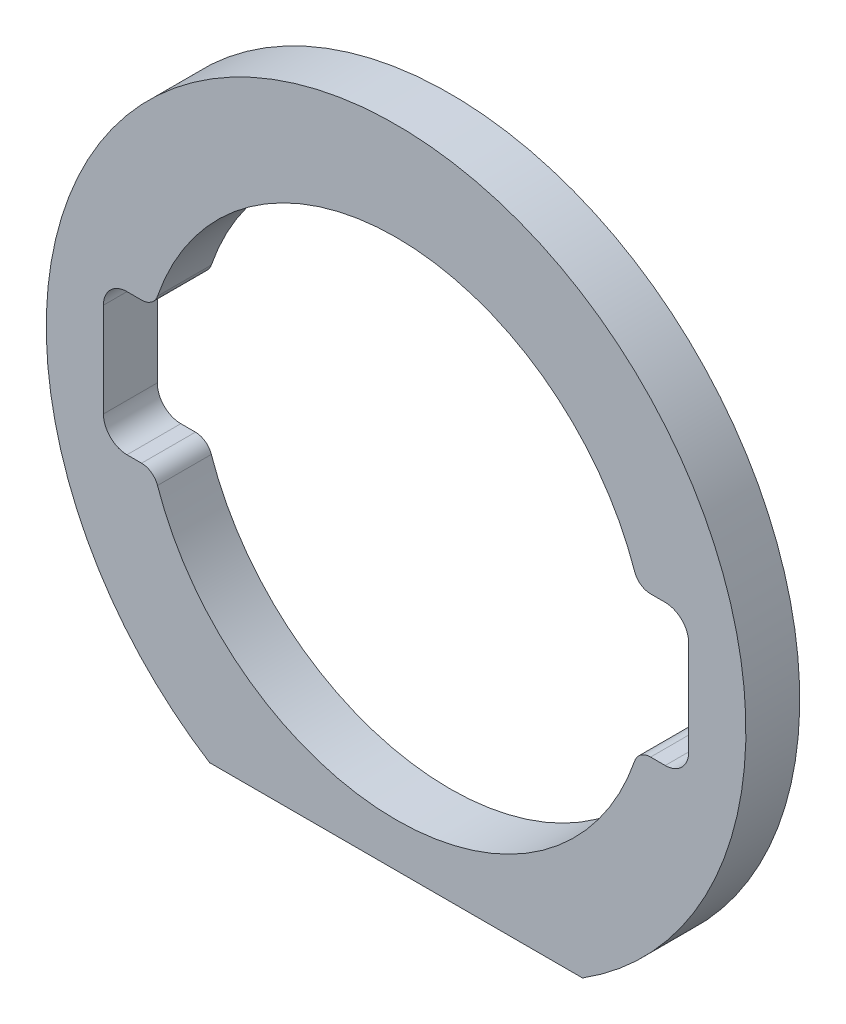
ISO-10303-21;
HEADER;
FILE_DESCRIPTION(('STEP AP214'),'2;1');
FILE_NAME('part.step','',(''),(''),'','','');
FILE_SCHEMA(('AUTOMOTIVE_DESIGN { 1 0 10303 214 1 1 1 1 }'));
ENDSEC;
DATA;
#1=APPLICATION_CONTEXT('core data for automotive mechanical design processes');
#2=APPLICATION_PROTOCOL_DEFINITION('international standard','automotive_design',2000,#1);
#3=PRODUCT_CONTEXT('',#1,'mechanical');
#4=PRODUCT('Part','Part','',(#3));
#5=PRODUCT_RELATED_PRODUCT_CATEGORY('part','',(#4));
#6=PRODUCT_DEFINITION_FORMATION('','',#4);
#7=PRODUCT_DEFINITION_CONTEXT('part definition',#1,'design');
#8=PRODUCT_DEFINITION('design','',#6,#7);
#9=PRODUCT_DEFINITION_SHAPE('','',#8);
#10=(LENGTH_UNIT() NAMED_UNIT(*) SI_UNIT(.MILLI.,.METRE.));
#11=(NAMED_UNIT(*) PLANE_ANGLE_UNIT() SI_UNIT($,.RADIAN.));
#12=(NAMED_UNIT(*) SI_UNIT($,.STERADIAN.) SOLID_ANGLE_UNIT());
#13=UNCERTAINTY_MEASURE_WITH_UNIT(LENGTH_MEASURE(1.E-05),#10,'distance_accuracy_value','');
#14=(GEOMETRIC_REPRESENTATION_CONTEXT(3) GLOBAL_UNCERTAINTY_ASSIGNED_CONTEXT((#13)) GLOBAL_UNIT_ASSIGNED_CONTEXT((#10,
#11,#12)) REPRESENTATION_CONTEXT('',''));
#15=CARTESIAN_POINT('',(0.,0.,0.));
#16=DIRECTION('',(0.,0.,1.));
#17=DIRECTION('',(1.,0.,0.));
#18=AXIS2_PLACEMENT_3D('',#15,#16,#17);
#19=CARTESIAN_POINT('',(0.,0.,8.));
#20=DIRECTION('',(0.,0.,-1.));
#21=DIRECTION('',(-1.,0.,0.));
#22=AXIS2_PLACEMENT_3D('',#19,#20,#21);
#23=CYLINDRICAL_SURFACE('',#22,52.);
#24=CARTESIAN_POINT('',(0.,0.,0.));
#25=DIRECTION('',(0.,0.,1.));
#26=DIRECTION('',(1.,0.,0.));
#27=AXIS2_PLACEMENT_3D('',#24,#25,#26);
#28=CIRCLE('',#27,52.);
#29=CARTESIAN_POINT('',(27.7128129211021,-44.,0.));
#30=VERTEX_POINT('',#29);
#31=CARTESIAN_POINT('',(-27.7128129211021,-44.,0.));
#32=VERTEX_POINT('',#31);
#33=EDGE_CURVE('E218',#30,#32,#28,.T.);
#34=ORIENTED_EDGE('',*,*,#33,.T.);
#35=DIRECTION('',(0.,0.,-1.));
#36=VECTOR('',#35,1.);
#37=CARTESIAN_POINT('',(-27.7128129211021,-44.,8.));
#38=LINE('',#37,#36);
#39=CARTESIAN_POINT('',(-27.7128129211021,-44.,8.));
#40=VERTEX_POINT('',#39);
#41=EDGE_CURVE('E257',#40,#32,#38,.T.);
#42=ORIENTED_EDGE('',*,*,#41,.F.);
#43=CARTESIAN_POINT('',(0.,0.,8.));
#44=DIRECTION('',(0.,0.,1.));
#45=DIRECTION('',(1.,0.,0.));
#46=AXIS2_PLACEMENT_3D('',#43,#44,#45);
#47=CIRCLE('',#46,52.);
#48=CARTESIAN_POINT('',(27.7128129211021,-44.,8.));
#49=VERTEX_POINT('',#48);
#50=EDGE_CURVE('E245',#49,#40,#47,.T.);
#51=ORIENTED_EDGE('',*,*,#50,.F.);
#52=DIRECTION('',(0.,0.,-1.));
#53=VECTOR('',#52,1.);
#54=CARTESIAN_POINT('',(27.7128129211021,-44.,8.));
#55=LINE('',#54,#53);
#56=EDGE_CURVE('E251',#49,#30,#55,.T.);
#57=ORIENTED_EDGE('',*,*,#56,.T.);
#58=EDGE_LOOP('',(#34,#42,#51,#57));
#59=FACE_BOUND('',#58,.T.);
#60=ADVANCED_FACE('F31',(#59),#23,.T.);
#61=CARTESIAN_POINT('',(-27.7128129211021,-44.,8.));
#62=DIRECTION('',(0.,1.,0.));
#63=DIRECTION('',(0.,0.,1.));
#64=AXIS2_PLACEMENT_3D('',#61,#62,#63);
#65=PLANE('',#64);
#66=DIRECTION('',(1.,0.,0.));
#67=VECTOR('',#66,1.);
#68=CARTESIAN_POINT('',(-27.7128129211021,-44.,0.));
#69=LINE('',#68,#67);
#70=EDGE_CURVE('E249',#32,#30,#69,.T.);
#71=ORIENTED_EDGE('',*,*,#70,.T.);
#72=ORIENTED_EDGE('',*,*,#56,.F.);
#73=DIRECTION('',(1.,0.,0.));
#74=VECTOR('',#73,1.);
#75=CARTESIAN_POINT('',(-27.7128129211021,-44.,8.));
#76=LINE('',#75,#74);
#77=EDGE_CURVE('E248',#40,#49,#76,.T.);
#78=ORIENTED_EDGE('',*,*,#77,.F.);
#79=ORIENTED_EDGE('',*,*,#41,.T.);
#80=EDGE_LOOP('',(#71,#72,#78,#79));
#81=FACE_BOUND('',#80,.T.);
#82=ADVANCED_FACE('F364',(#81),#65,.F.);
#83=CARTESIAN_POINT('',(0.,0.,8.));
#84=DIRECTION('',(0.,0.,1.));
#85=DIRECTION('',(1.,0.,0.));
#86=AXIS2_PLACEMENT_3D('',#83,#84,#85);
#87=PLANE('',#86);
#88=CARTESIAN_POINT('',(37.8285606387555,13.,8.));
#89=DIRECTION('',(0.,0.,-1.));
#90=DIRECTION('',(1.,0.,0.));
#91=AXIS2_PLACEMENT_3D('',#88,#89,#90);
#92=CIRCLE('',#91,2.5);
#93=CARTESIAN_POINT('',(37.8285606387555,10.5,8.));
#94=VERTEX_POINT('',#93);
#95=CARTESIAN_POINT('',(35.4642755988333,12.1875,8.));
#96=VERTEX_POINT('',#95);
#97=EDGE_CURVE('E45',#94,#96,#92,.T.);
#98=ORIENTED_EDGE('',*,*,#97,.F.);
#99=DIRECTION('',(-1.,0.,0.));
#100=VECTOR('',#99,1.);
#101=CARTESIAN_POINT('',(37.8285606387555,10.5,8.));
#102=LINE('',#101,#100);
#103=CARTESIAN_POINT('',(40.,10.5,8.));
#104=VERTEX_POINT('',#103);
#105=EDGE_CURVE('E213',#104,#94,#102,.T.);
#106=ORIENTED_EDGE('',*,*,#105,.F.);
#107=CARTESIAN_POINT('',(40.,7.,8.));
#108=DIRECTION('',(0.,0.,1.));
#109=DIRECTION('',(-1.,0.,0.));
#110=AXIS2_PLACEMENT_3D('',#107,#108,#109);
#111=CIRCLE('',#110,3.5);
#112=CARTESIAN_POINT('',(43.5,6.99999999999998,8.));
#113=VERTEX_POINT('',#112);
#114=EDGE_CURVE('E210',#113,#104,#111,.T.);
#115=ORIENTED_EDGE('',*,*,#114,.F.);
#116=DIRECTION('',(0.,1.,0.));
#117=VECTOR('',#116,1.);
#118=CARTESIAN_POINT('',(43.5,6.99999999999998,8.));
#119=LINE('',#118,#117);
#120=CARTESIAN_POINT('',(43.5,-6.99999999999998,8.));
#121=VERTEX_POINT('',#120);
#122=EDGE_CURVE('E207',#121,#113,#119,.T.);
#123=ORIENTED_EDGE('',*,*,#122,.F.);
#124=CARTESIAN_POINT('',(40.,-7.,8.));
#125=DIRECTION('',(0.,0.,1.));
#126=DIRECTION('',(1.,0.,0.));
#127=AXIS2_PLACEMENT_3D('',#124,#125,#126);
#128=CIRCLE('',#127,3.5);
#129=CARTESIAN_POINT('',(40.,-10.5,8.));
#130=VERTEX_POINT('',#129);
#131=EDGE_CURVE('E204',#130,#121,#128,.T.);
#132=ORIENTED_EDGE('',*,*,#131,.F.);
#133=DIRECTION('',(1.,0.,0.));
#134=VECTOR('',#133,1.);
#135=CARTESIAN_POINT('',(37.8285606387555,-10.5,8.));
#136=LINE('',#135,#134);
#137=CARTESIAN_POINT('',(37.8285606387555,-10.5,8.));
#138=VERTEX_POINT('',#137);
#139=EDGE_CURVE('E201',#138,#130,#136,.T.);
#140=ORIENTED_EDGE('',*,*,#139,.F.);
#141=CARTESIAN_POINT('',(37.8285606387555,-13.,8.));
#142=DIRECTION('',(0.,0.,-1.));
#143=DIRECTION('',(-1.,0.,0.));
#144=AXIS2_PLACEMENT_3D('',#141,#142,#143);
#145=CIRCLE('',#144,2.5);
#146=CARTESIAN_POINT('',(35.4642755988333,-12.1875,8.));
#147=VERTEX_POINT('',#146);
#148=EDGE_CURVE('E198',#147,#138,#145,.T.);
#149=ORIENTED_EDGE('',*,*,#148,.F.);
#150=CARTESIAN_POINT('',(0.,0.,8.));
#151=DIRECTION('',(0.,0.,1.));
#152=DIRECTION('',(1.,0.,0.));
#153=AXIS2_PLACEMENT_3D('',#150,#151,#152);
#154=CIRCLE('',#153,37.5);
#155=CARTESIAN_POINT('',(-35.4642755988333,-12.1875,8.));
#156=VERTEX_POINT('',#155);
#157=EDGE_CURVE('E195',#156,#147,#154,.T.);
#158=ORIENTED_EDGE('',*,*,#157,.F.);
#159=CARTESIAN_POINT('',(-37.8285606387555,-13.,8.));
#160=DIRECTION('',(0.,0.,-1.));
#161=DIRECTION('',(1.,0.,0.));
#162=AXIS2_PLACEMENT_3D('',#159,#160,#161);
#163=CIRCLE('',#162,2.5);
#164=CARTESIAN_POINT('',(-37.8285606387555,-10.5,8.));
#165=VERTEX_POINT('',#164);
#166=EDGE_CURVE('E192',#165,#156,#163,.T.);
#167=ORIENTED_EDGE('',*,*,#166,.F.);
#168=DIRECTION('',(1.,0.,0.));
#169=VECTOR('',#168,1.);
#170=CARTESIAN_POINT('',(-40.,-10.5,8.));
#171=LINE('',#170,#169);
#172=CARTESIAN_POINT('',(-40.,-10.5,8.));
#173=VERTEX_POINT('',#172);
#174=EDGE_CURVE('E189',#173,#165,#171,.T.);
#175=ORIENTED_EDGE('',*,*,#174,.F.);
#176=CARTESIAN_POINT('',(-40.,-7.,8.));
#177=DIRECTION('',(0.,0.,1.));
#178=DIRECTION('',(-1.,0.,0.));
#179=AXIS2_PLACEMENT_3D('',#176,#177,#178);
#180=CIRCLE('',#179,3.5);
#181=CARTESIAN_POINT('',(-43.5,-6.99999999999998,8.));
#182=VERTEX_POINT('',#181);
#183=EDGE_CURVE('E186',#182,#173,#180,.T.);
#184=ORIENTED_EDGE('',*,*,#183,.F.);
#185=DIRECTION('',(0.,-1.,0.));
#186=VECTOR('',#185,1.);
#187=CARTESIAN_POINT('',(-43.5,6.99999999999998,8.));
#188=LINE('',#187,#186);
#189=CARTESIAN_POINT('',(-43.5,6.99999999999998,8.));
#190=VERTEX_POINT('',#189);
#191=EDGE_CURVE('E183',#190,#182,#188,.T.);
#192=ORIENTED_EDGE('',*,*,#191,.F.);
#193=CARTESIAN_POINT('',(-40.,7.,8.));
#194=DIRECTION('',(0.,0.,1.));
#195=DIRECTION('',(1.,0.,0.));
#196=AXIS2_PLACEMENT_3D('',#193,#194,#195);
#197=CIRCLE('',#196,3.5);
#198=CARTESIAN_POINT('',(-40.,10.5,8.));
#199=VERTEX_POINT('',#198);
#200=EDGE_CURVE('E177',#199,#190,#197,.T.);
#201=ORIENTED_EDGE('',*,*,#200,.F.);
#202=DIRECTION('',(-1.,0.,0.));
#203=VECTOR('',#202,1.);
#204=CARTESIAN_POINT('',(-40.,10.5,8.));
#205=LINE('',#204,#203);
#206=CARTESIAN_POINT('',(-37.8285606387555,10.5,8.));
#207=VERTEX_POINT('',#206);
#208=EDGE_CURVE('E175',#207,#199,#205,.T.);
#209=ORIENTED_EDGE('',*,*,#208,.F.);
#210=CARTESIAN_POINT('',(-37.8285606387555,13.,8.));
#211=DIRECTION('',(0.,0.,-1.));
#212=DIRECTION('',(1.,0.,0.));
#213=AXIS2_PLACEMENT_3D('',#210,#211,#212);
#214=CIRCLE('',#213,2.5);
#215=CARTESIAN_POINT('',(-35.4642755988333,12.1875,8.));
#216=VERTEX_POINT('',#215);
#217=EDGE_CURVE('E158',#216,#207,#214,.T.);
#218=ORIENTED_EDGE('',*,*,#217,.F.);
#219=CARTESIAN_POINT('',(0.,0.,8.));
#220=DIRECTION('',(0.,0.,1.));
#221=DIRECTION('',(1.,0.,0.));
#222=AXIS2_PLACEMENT_3D('',#219,#220,#221);
#223=CIRCLE('',#222,37.5);
#224=EDGE_CURVE('E167',#96,#216,#223,.T.);
#225=ORIENTED_EDGE('',*,*,#224,.F.);
#226=EDGE_LOOP('',(#98,#106,#115,#123,#132,#140,#149,#158,#167,#175,#184,#192,#201,#209,#218,#225));
#227=FACE_BOUND('',#226,.T.);
#228=ORIENTED_EDGE('',*,*,#50,.T.);
#229=ORIENTED_EDGE('',*,*,#77,.T.);
#230=EDGE_LOOP('',(#228,#229));
#231=FACE_BOUND('',#230,.T.);
#232=ADVANCED_FACE('F171',(#227,#231),#87,.T.);
#233=CARTESIAN_POINT('',(0.,0.,0.));
#234=DIRECTION('',(0.,0.,1.));
#235=DIRECTION('',(1.,0.,0.));
#236=AXIS2_PLACEMENT_3D('',#233,#234,#235);
#237=PLANE('',#236);
#238=DIRECTION('',(-1.,0.,0.));
#239=VECTOR('',#238,1.);
#240=CARTESIAN_POINT('',(0.,10.5,0.));
#241=LINE('',#240,#239);
#242=CARTESIAN_POINT('',(40.,10.5,0.));
#243=VERTEX_POINT('',#242);
#244=CARTESIAN_POINT('',(37.8285606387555,10.5,0.));
#245=VERTEX_POINT('',#244);
#246=EDGE_CURVE('E38',#243,#245,#241,.T.);
#247=ORIENTED_EDGE('',*,*,#246,.T.);
#248=CARTESIAN_POINT('',(37.8285606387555,13.,0.));
#249=DIRECTION('',(0.,0.,1.));
#250=DIRECTION('',(1.,0.,0.));
#251=AXIS2_PLACEMENT_3D('',#248,#249,#250);
#252=CIRCLE('',#251,2.5);
#253=CARTESIAN_POINT('',(35.4642755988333,12.1875,0.));
#254=VERTEX_POINT('',#253);
#255=EDGE_CURVE('E11',#245,#254,#252,.F.);
#256=ORIENTED_EDGE('',*,*,#255,.T.);
#257=CARTESIAN_POINT('',(0.,0.,0.));
#258=DIRECTION('',(0.,0.,1.));
#259=DIRECTION('',(1.,0.,0.));
#260=AXIS2_PLACEMENT_3D('',#257,#258,#259);
#261=CIRCLE('',#260,37.5);
#262=CARTESIAN_POINT('',(-35.4642755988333,12.1875,0.));
#263=VERTEX_POINT('',#262);
#264=EDGE_CURVE('E260',#254,#263,#261,.T.);
#265=ORIENTED_EDGE('',*,*,#264,.T.);
#266=CARTESIAN_POINT('',(-37.8285606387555,13.,0.));
#267=DIRECTION('',(0.,0.,1.));
#268=DIRECTION('',(1.,0.,0.));
#269=AXIS2_PLACEMENT_3D('',#266,#267,#268);
#270=CIRCLE('',#269,2.5);
#271=CARTESIAN_POINT('',(-37.8285606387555,10.5,0.));
#272=VERTEX_POINT('',#271);
#273=EDGE_CURVE('E161',#263,#272,#270,.F.);
#274=ORIENTED_EDGE('',*,*,#273,.T.);
#275=DIRECTION('',(-1.,0.,0.));
#276=VECTOR('',#275,1.);
#277=CARTESIAN_POINT('',(0.,10.5,0.));
#278=LINE('',#277,#276);
#279=CARTESIAN_POINT('',(-40.,10.5,0.));
#280=VERTEX_POINT('',#279);
#281=EDGE_CURVE('E263',#272,#280,#278,.T.);
#282=ORIENTED_EDGE('',*,*,#281,.T.);
#283=CARTESIAN_POINT('',(-40.,7.,0.));
#284=DIRECTION('',(0.,0.,1.));
#285=DIRECTION('',(1.,0.,0.));
#286=AXIS2_PLACEMENT_3D('',#283,#284,#285);
#287=CIRCLE('',#286,3.5);
#288=CARTESIAN_POINT('',(-43.5,6.99999999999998,0.));
#289=VERTEX_POINT('',#288);
#290=EDGE_CURVE('E266',#280,#289,#287,.T.);
#291=ORIENTED_EDGE('',*,*,#290,.T.);
#292=DIRECTION('',(0.,-1.,0.));
#293=VECTOR('',#292,1.);
#294=CARTESIAN_POINT('',(-43.5,0.,0.));
#295=LINE('',#294,#293);
#296=CARTESIAN_POINT('',(-43.5,-6.99999999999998,0.));
#297=VERTEX_POINT('',#296);
#298=EDGE_CURVE('E269',#289,#297,#295,.T.);
#299=ORIENTED_EDGE('',*,*,#298,.T.);
#300=CARTESIAN_POINT('',(-40.,-7.,0.));
#301=DIRECTION('',(0.,0.,1.));
#302=DIRECTION('',(1.,0.,0.));
#303=AXIS2_PLACEMENT_3D('',#300,#301,#302);
#304=CIRCLE('',#303,3.5);
#305=CARTESIAN_POINT('',(-40.,-10.5,0.));
#306=VERTEX_POINT('',#305);
#307=EDGE_CURVE('E272',#297,#306,#304,.T.);
#308=ORIENTED_EDGE('',*,*,#307,.T.);
#309=DIRECTION('',(1.,0.,0.));
#310=VECTOR('',#309,1.);
#311=CARTESIAN_POINT('',(0.,-10.5,0.));
#312=LINE('',#311,#310);
#313=CARTESIAN_POINT('',(-37.8285606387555,-10.5,0.));
#314=VERTEX_POINT('',#313);
#315=EDGE_CURVE('E275',#306,#314,#312,.T.);
#316=ORIENTED_EDGE('',*,*,#315,.T.);
#317=CARTESIAN_POINT('',(-37.8285606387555,-13.,0.));
#318=DIRECTION('',(0.,0.,1.));
#319=DIRECTION('',(1.,0.,0.));
#320=AXIS2_PLACEMENT_3D('',#317,#318,#319);
#321=CIRCLE('',#320,2.5);
#322=CARTESIAN_POINT('',(-35.4642755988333,-12.1875,0.));
#323=VERTEX_POINT('',#322);
#324=EDGE_CURVE('E278',#314,#323,#321,.F.);
#325=ORIENTED_EDGE('',*,*,#324,.T.);
#326=CARTESIAN_POINT('',(0.,0.,0.));
#327=DIRECTION('',(0.,0.,1.));
#328=DIRECTION('',(1.,0.,0.));
#329=AXIS2_PLACEMENT_3D('',#326,#327,#328);
#330=CIRCLE('',#329,37.5);
#331=CARTESIAN_POINT('',(35.4642755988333,-12.1875,0.));
#332=VERTEX_POINT('',#331);
#333=EDGE_CURVE('E281',#323,#332,#330,.T.);
#334=ORIENTED_EDGE('',*,*,#333,.T.);
#335=CARTESIAN_POINT('',(37.8285606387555,-13.,0.));
#336=DIRECTION('',(0.,0.,1.));
#337=DIRECTION('',(1.,0.,0.));
#338=AXIS2_PLACEMENT_3D('',#335,#336,#337);
#339=CIRCLE('',#338,2.5);
#340=CARTESIAN_POINT('',(37.8285606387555,-10.5,0.));
#341=VERTEX_POINT('',#340);
#342=EDGE_CURVE('E284',#332,#341,#339,.F.);
#343=ORIENTED_EDGE('',*,*,#342,.T.);
#344=DIRECTION('',(1.,0.,0.));
#345=VECTOR('',#344,1.);
#346=CARTESIAN_POINT('',(0.,-10.4999999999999,0.));
#347=LINE('',#346,#345);
#348=CARTESIAN_POINT('',(40.,-10.5,0.));
#349=VERTEX_POINT('',#348);
#350=EDGE_CURVE('E287',#341,#349,#347,.T.);
#351=ORIENTED_EDGE('',*,*,#350,.T.);
#352=CARTESIAN_POINT('',(40.,-7.,0.));
#353=DIRECTION('',(0.,0.,1.));
#354=DIRECTION('',(1.,0.,0.));
#355=AXIS2_PLACEMENT_3D('',#352,#353,#354);
#356=CIRCLE('',#355,3.5);
#357=CARTESIAN_POINT('',(43.5,-6.99999999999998,0.));
#358=VERTEX_POINT('',#357);
#359=EDGE_CURVE('E290',#349,#358,#356,.T.);
#360=ORIENTED_EDGE('',*,*,#359,.T.);
#361=DIRECTION('',(0.,1.,0.));
#362=VECTOR('',#361,1.);
#363=CARTESIAN_POINT('',(43.5,0.,0.));
#364=LINE('',#363,#362);
#365=CARTESIAN_POINT('',(43.5,6.99999999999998,0.));
#366=VERTEX_POINT('',#365);
#367=EDGE_CURVE('E293',#358,#366,#364,.T.);
#368=ORIENTED_EDGE('',*,*,#367,.T.);
#369=CARTESIAN_POINT('',(40.,7.,0.));
#370=DIRECTION('',(0.,0.,1.));
#371=DIRECTION('',(1.,0.,0.));
#372=AXIS2_PLACEMENT_3D('',#369,#370,#371);
#373=CIRCLE('',#372,3.5);
#374=EDGE_CURVE('E296',#366,#243,#373,.T.);
#375=ORIENTED_EDGE('',*,*,#374,.T.);
#376=EDGE_LOOP('',(#247,#256,#265,#274,#282,#291,#299,#308,#316,#325,#334,#343,#351,#360,#368,#375));
#377=FACE_BOUND('',#376,.T.);
#378=ORIENTED_EDGE('',*,*,#33,.F.);
#379=ORIENTED_EDGE('',*,*,#70,.F.);
#380=EDGE_LOOP('',(#378,#379));
#381=FACE_BOUND('',#380,.T.);
#382=ADVANCED_FACE('F300',(#377,#381),#237,.F.);
#383=CARTESIAN_POINT('',(37.8285606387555,13.,-2.));
#384=DIRECTION('',(0.,0.,1.));
#385=DIRECTION('',(1.,0.,0.));
#386=AXIS2_PLACEMENT_3D('',#383,#384,#385);
#387=CYLINDRICAL_SURFACE('',#386,2.5);
#388=DIRECTION('',(0.,0.,1.));
#389=VECTOR('',#388,1.);
#390=CARTESIAN_POINT('',(37.8285606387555,10.5,-2.));
#391=LINE('',#390,#389);
#392=EDGE_CURVE('E216',#245,#94,#391,.T.);
#393=ORIENTED_EDGE('',*,*,#392,.T.);
#394=ORIENTED_EDGE('',*,*,#97,.T.);
#395=DIRECTION('',(0.,0.,1.));
#396=VECTOR('',#395,1.);
#397=CARTESIAN_POINT('',(35.4642755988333,12.1875,-2.));
#398=LINE('',#397,#396);
#399=EDGE_CURVE('E164',#254,#96,#398,.T.);
#400=ORIENTED_EDGE('',*,*,#399,.F.);
#401=ORIENTED_EDGE('',*,*,#255,.F.);
#402=EDGE_LOOP('',(#393,#394,#400,#401));
#403=FACE_BOUND('',#402,.T.);
#404=ADVANCED_FACE('F352',(#403),#387,.T.);
#405=CARTESIAN_POINT('',(37.8285606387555,10.5,-2.));
#406=DIRECTION('',(0.,1.,0.));
#407=DIRECTION('',(-1.,0.,0.));
#408=AXIS2_PLACEMENT_3D('',#405,#406,#407);
#409=PLANE('',#408);
#410=DIRECTION('',(0.,0.,1.));
#411=VECTOR('',#410,1.);
#412=CARTESIAN_POINT('',(40.,10.5,-2.));
#413=LINE('',#412,#411);
#414=EDGE_CURVE('E219',#243,#104,#413,.T.);
#415=ORIENTED_EDGE('',*,*,#414,.T.);
#416=ORIENTED_EDGE('',*,*,#105,.T.);
#417=ORIENTED_EDGE('',*,*,#392,.F.);
#418=ORIENTED_EDGE('',*,*,#246,.F.);
#419=EDGE_LOOP('',(#415,#416,#417,#418));
#420=FACE_BOUND('',#419,.T.);
#421=ADVANCED_FACE('F305',(#420),#409,.F.);
#422=CARTESIAN_POINT('',(40.,7.,-2.));
#423=DIRECTION('',(0.,0.,1.));
#424=DIRECTION('',(1.,0.,0.));
#425=AXIS2_PLACEMENT_3D('',#422,#423,#424);
#426=CYLINDRICAL_SURFACE('',#425,3.5);
#427=DIRECTION('',(0.,0.,1.));
#428=VECTOR('',#427,1.);
#429=CARTESIAN_POINT('',(43.5,6.99999999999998,-2.));
#430=LINE('',#429,#428);
#431=EDGE_CURVE('E221',#366,#113,#430,.T.);
#432=ORIENTED_EDGE('',*,*,#431,.T.);
#433=ORIENTED_EDGE('',*,*,#114,.T.);
#434=ORIENTED_EDGE('',*,*,#414,.F.);
#435=ORIENTED_EDGE('',*,*,#374,.F.);
#436=EDGE_LOOP('',(#432,#433,#434,#435));
#437=FACE_BOUND('',#436,.T.);
#438=ADVANCED_FACE('F307',(#437),#426,.F.);
#439=CARTESIAN_POINT('',(43.5,6.99999999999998,-2.));
#440=DIRECTION('',(1.,0.,0.));
#441=DIRECTION('',(0.,0.,-1.));
#442=AXIS2_PLACEMENT_3D('',#439,#440,#441);
#443=PLANE('',#442);
#444=DIRECTION('',(0.,0.,1.));
#445=VECTOR('',#444,1.);
#446=CARTESIAN_POINT('',(43.5,-6.99999999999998,-2.));
#447=LINE('',#446,#445);
#448=EDGE_CURVE('E223',#358,#121,#447,.T.);
#449=ORIENTED_EDGE('',*,*,#448,.T.);
#450=ORIENTED_EDGE('',*,*,#122,.T.);
#451=ORIENTED_EDGE('',*,*,#431,.F.);
#452=ORIENTED_EDGE('',*,*,#367,.F.);
#453=EDGE_LOOP('',(#449,#450,#451,#452));
#454=FACE_BOUND('',#453,.T.);
#455=ADVANCED_FACE('F315',(#454),#443,.F.);
#456=CARTESIAN_POINT('',(40.,-7.,-2.));
#457=DIRECTION('',(0.,0.,1.));
#458=DIRECTION('',(1.,0.,0.));
#459=AXIS2_PLACEMENT_3D('',#456,#457,#458);
#460=CYLINDRICAL_SURFACE('',#459,3.5);
#461=DIRECTION('',(0.,0.,1.));
#462=VECTOR('',#461,1.);
#463=CARTESIAN_POINT('',(40.,-10.5,-2.));
#464=LINE('',#463,#462);
#465=EDGE_CURVE('E225',#349,#130,#464,.T.);
#466=ORIENTED_EDGE('',*,*,#465,.T.);
#467=ORIENTED_EDGE('',*,*,#131,.T.);
#468=ORIENTED_EDGE('',*,*,#448,.F.);
#469=ORIENTED_EDGE('',*,*,#359,.F.);
#470=EDGE_LOOP('',(#466,#467,#468,#469));
#471=FACE_BOUND('',#470,.T.);
#472=ADVANCED_FACE('F318',(#471),#460,.F.);
#473=CARTESIAN_POINT('',(37.8285606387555,-10.5,-2.));
#474=DIRECTION('',(0.,-1.,0.));
#475=DIRECTION('',(1.,0.,0.));
#476=AXIS2_PLACEMENT_3D('',#473,#474,#475);
#477=PLANE('',#476);
#478=DIRECTION('',(0.,0.,1.));
#479=VECTOR('',#478,1.);
#480=CARTESIAN_POINT('',(37.8285606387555,-10.5,-2.));
#481=LINE('',#480,#479);
#482=EDGE_CURVE('E227',#341,#138,#481,.T.);
#483=ORIENTED_EDGE('',*,*,#482,.T.);
#484=ORIENTED_EDGE('',*,*,#139,.T.);
#485=ORIENTED_EDGE('',*,*,#465,.F.);
#486=ORIENTED_EDGE('',*,*,#350,.F.);
#487=EDGE_LOOP('',(#483,#484,#485,#486));
#488=FACE_BOUND('',#487,.T.);
#489=ADVANCED_FACE('F321',(#488),#477,.F.);
#490=CARTESIAN_POINT('',(37.8285606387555,-13.,-2.));
#491=DIRECTION('',(0.,0.,1.));
#492=DIRECTION('',(1.,0.,0.));
#493=AXIS2_PLACEMENT_3D('',#490,#491,#492);
#494=CYLINDRICAL_SURFACE('',#493,2.5);
#495=DIRECTION('',(0.,0.,1.));
#496=VECTOR('',#495,1.);
#497=CARTESIAN_POINT('',(35.4642755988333,-12.1875,-2.));
#498=LINE('',#497,#496);
#499=EDGE_CURVE('E229',#332,#147,#498,.T.);
#500=ORIENTED_EDGE('',*,*,#499,.T.);
#501=ORIENTED_EDGE('',*,*,#148,.T.);
#502=ORIENTED_EDGE('',*,*,#482,.F.);
#503=ORIENTED_EDGE('',*,*,#342,.F.);
#504=EDGE_LOOP('',(#500,#501,#502,#503));
#505=FACE_BOUND('',#504,.T.);
#506=ADVANCED_FACE('F327',(#505),#494,.T.);
#507=CARTESIAN_POINT('',(0.,0.,-2.));
#508=DIRECTION('',(0.,0.,1.));
#509=DIRECTION('',(1.,0.,0.));
#510=AXIS2_PLACEMENT_3D('',#507,#508,#509);
#511=CYLINDRICAL_SURFACE('',#510,37.5);
#512=DIRECTION('',(0.,0.,1.));
#513=VECTOR('',#512,1.);
#514=CARTESIAN_POINT('',(-35.4642755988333,-12.1875,-2.));
#515=LINE('',#514,#513);
#516=EDGE_CURVE('E231',#323,#156,#515,.T.);
#517=ORIENTED_EDGE('',*,*,#516,.T.);
#518=ORIENTED_EDGE('',*,*,#157,.T.);
#519=ORIENTED_EDGE('',*,*,#499,.F.);
#520=ORIENTED_EDGE('',*,*,#333,.F.);
#521=EDGE_LOOP('',(#517,#518,#519,#520));
#522=FACE_BOUND('',#521,.T.);
#523=ADVANCED_FACE('F330',(#522),#511,.F.);
#524=CARTESIAN_POINT('',(-37.8285606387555,-13.,-2.));
#525=DIRECTION('',(0.,0.,1.));
#526=DIRECTION('',(1.,0.,0.));
#527=AXIS2_PLACEMENT_3D('',#524,#525,#526);
#528=CYLINDRICAL_SURFACE('',#527,2.5);
#529=DIRECTION('',(0.,0.,1.));
#530=VECTOR('',#529,1.);
#531=CARTESIAN_POINT('',(-37.8285606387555,-10.5,-2.));
#532=LINE('',#531,#530);
#533=EDGE_CURVE('E233',#314,#165,#532,.T.);
#534=ORIENTED_EDGE('',*,*,#533,.T.);
#535=ORIENTED_EDGE('',*,*,#166,.T.);
#536=ORIENTED_EDGE('',*,*,#516,.F.);
#537=ORIENTED_EDGE('',*,*,#324,.F.);
#538=EDGE_LOOP('',(#534,#535,#536,#537));
#539=FACE_BOUND('',#538,.T.);
#540=ADVANCED_FACE('F333',(#539),#528,.T.);
#541=CARTESIAN_POINT('',(-40.,-10.5,-2.));
#542=DIRECTION('',(0.,-1.,0.));
#543=DIRECTION('',(0.,0.,-1.));
#544=AXIS2_PLACEMENT_3D('',#541,#542,#543);
#545=PLANE('',#544);
#546=DIRECTION('',(0.,0.,1.));
#547=VECTOR('',#546,1.);
#548=CARTESIAN_POINT('',(-40.,-10.5,-2.));
#549=LINE('',#548,#547);
#550=EDGE_CURVE('E235',#306,#173,#549,.T.);
#551=ORIENTED_EDGE('',*,*,#550,.T.);
#552=ORIENTED_EDGE('',*,*,#174,.T.);
#553=ORIENTED_EDGE('',*,*,#533,.F.);
#554=ORIENTED_EDGE('',*,*,#315,.F.);
#555=EDGE_LOOP('',(#551,#552,#553,#554));
#556=FACE_BOUND('',#555,.T.);
#557=ADVANCED_FACE('F339',(#556),#545,.F.);
#558=CARTESIAN_POINT('',(-40.,-7.,-2.));
#559=DIRECTION('',(0.,0.,1.));
#560=DIRECTION('',(1.,0.,0.));
#561=AXIS2_PLACEMENT_3D('',#558,#559,#560);
#562=CYLINDRICAL_SURFACE('',#561,3.5);
#563=DIRECTION('',(0.,0.,1.));
#564=VECTOR('',#563,1.);
#565=CARTESIAN_POINT('',(-43.5,-6.99999999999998,-2.));
#566=LINE('',#565,#564);
#567=EDGE_CURVE('E237',#297,#182,#566,.T.);
#568=ORIENTED_EDGE('',*,*,#567,.T.);
#569=ORIENTED_EDGE('',*,*,#183,.T.);
#570=ORIENTED_EDGE('',*,*,#550,.F.);
#571=ORIENTED_EDGE('',*,*,#307,.F.);
#572=EDGE_LOOP('',(#568,#569,#570,#571));
#573=FACE_BOUND('',#572,.T.);
#574=ADVANCED_FACE('F342',(#573),#562,.F.);
#575=CARTESIAN_POINT('',(-43.5,6.99999999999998,-2.));
#576=DIRECTION('',(-1.,0.,0.));
#577=DIRECTION('',(0.,0.,1.));
#578=AXIS2_PLACEMENT_3D('',#575,#576,#577);
#579=PLANE('',#578);
#580=DIRECTION('',(0.,0.,1.));
#581=VECTOR('',#580,1.);
#582=CARTESIAN_POINT('',(-43.5,6.99999999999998,-2.));
#583=LINE('',#582,#581);
#584=EDGE_CURVE('E239',#289,#190,#583,.T.);
#585=ORIENTED_EDGE('',*,*,#584,.T.);
#586=ORIENTED_EDGE('',*,*,#191,.T.);
#587=ORIENTED_EDGE('',*,*,#567,.F.);
#588=ORIENTED_EDGE('',*,*,#298,.F.);
#589=EDGE_LOOP('',(#585,#586,#587,#588));
#590=FACE_BOUND('',#589,.T.);
#591=ADVANCED_FACE('F345',(#590),#579,.F.);
#592=CARTESIAN_POINT('',(-40.,7.,-2.));
#593=DIRECTION('',(0.,0.,1.));
#594=DIRECTION('',(1.,0.,0.));
#595=AXIS2_PLACEMENT_3D('',#592,#593,#594);
#596=CYLINDRICAL_SURFACE('',#595,3.5);
#597=DIRECTION('',(0.,0.,1.));
#598=VECTOR('',#597,1.);
#599=CARTESIAN_POINT('',(-40.,10.5,-2.));
#600=LINE('',#599,#598);
#601=EDGE_CURVE('E241',#280,#199,#600,.T.);
#602=ORIENTED_EDGE('',*,*,#601,.T.);
#603=ORIENTED_EDGE('',*,*,#200,.T.);
#604=ORIENTED_EDGE('',*,*,#584,.F.);
#605=ORIENTED_EDGE('',*,*,#290,.F.);
#606=EDGE_LOOP('',(#602,#603,#604,#605));
#607=FACE_BOUND('',#606,.T.);
#608=ADVANCED_FACE('F348',(#607),#596,.F.);
#609=CARTESIAN_POINT('',(-40.,10.5,-2.));
#610=DIRECTION('',(0.,1.,0.));
#611=DIRECTION('',(-1.,0.,0.));
#612=AXIS2_PLACEMENT_3D('',#609,#610,#611);
#613=PLANE('',#612);
#614=DIRECTION('',(0.,0.,1.));
#615=VECTOR('',#614,1.);
#616=CARTESIAN_POINT('',(-37.8285606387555,10.5,-2.));
#617=LINE('',#616,#615);
#618=EDGE_CURVE('E163',#272,#207,#617,.T.);
#619=ORIENTED_EDGE('',*,*,#618,.T.);
#620=ORIENTED_EDGE('',*,*,#208,.T.);
#621=ORIENTED_EDGE('',*,*,#601,.F.);
#622=ORIENTED_EDGE('',*,*,#281,.F.);
#623=EDGE_LOOP('',(#619,#620,#621,#622));
#624=FACE_BOUND('',#623,.T.);
#625=ADVANCED_FACE('F351',(#624),#613,.F.);
#626=CARTESIAN_POINT('',(-37.8285606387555,13.,-2.));
#627=DIRECTION('',(0.,0.,1.));
#628=DIRECTION('',(1.,0.,0.));
#629=AXIS2_PLACEMENT_3D('',#626,#627,#628);
#630=CYLINDRICAL_SURFACE('',#629,2.5);
#631=DIRECTION('',(0.,0.,1.));
#632=VECTOR('',#631,1.);
#633=CARTESIAN_POINT('',(-35.4642755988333,12.1875,-2.));
#634=LINE('',#633,#632);
#635=EDGE_CURVE('E53',#263,#216,#634,.T.);
#636=ORIENTED_EDGE('',*,*,#635,.T.);
#637=ORIENTED_EDGE('',*,*,#217,.T.);
#638=ORIENTED_EDGE('',*,*,#618,.F.);
#639=ORIENTED_EDGE('',*,*,#273,.F.);
#640=EDGE_LOOP('',(#636,#637,#638,#639));
#641=FACE_BOUND('',#640,.T.);
#642=ADVANCED_FACE('F155',(#641),#630,.T.);
#643=CARTESIAN_POINT('',(0.,0.,-2.));
#644=DIRECTION('',(0.,0.,1.));
#645=DIRECTION('',(1.,0.,0.));
#646=AXIS2_PLACEMENT_3D('',#643,#644,#645);
#647=CYLINDRICAL_SURFACE('',#646,37.5);
#648=ORIENTED_EDGE('',*,*,#399,.T.);
#649=ORIENTED_EDGE('',*,*,#224,.T.);
#650=ORIENTED_EDGE('',*,*,#635,.F.);
#651=ORIENTED_EDGE('',*,*,#264,.F.);
#652=EDGE_LOOP('',(#648,#649,#650,#651));
#653=FACE_BOUND('',#652,.T.);
#654=ADVANCED_FACE('F168',(#653),#647,.F.);
#655=CLOSED_SHELL('',(#60,#82,#232,#382,#404,#421,#438,#455,#472,#489,#506,#523,#540,#557,#574,
#591,#608,#625,#642,#654));
#656=MANIFOLD_SOLID_BREP('B2',#655);
#657=ADVANCED_BREP_SHAPE_REPRESENTATION('',(#18,#656),#14);
#658=SHAPE_DEFINITION_REPRESENTATION(#9,#657);
ENDSEC;
END-ISO-10303-21;
